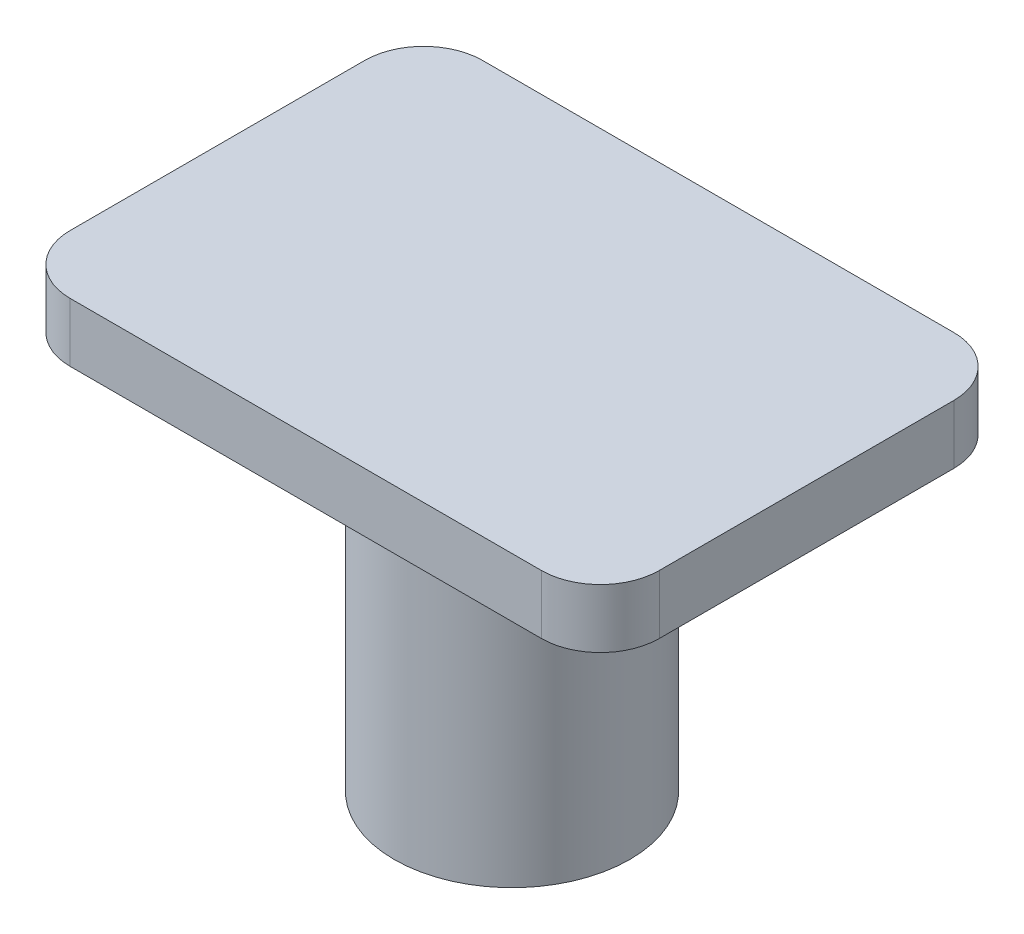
from build123d import *

# Parameters (mm, degrees)
SKETCH1_R           = 10
SKETCH1_R_2         = 8
EXTRUDE_THIN1_DEPTH = 30
SKETCH2_W           = 50
SKETCH2_H           = 35
EXTRUDE1_DEPTH      = 5
FILLET1_R           = 5


with BuildPart() as part:
    # Sketch1 → Extrude-Thin1 (new body)
    with BuildSketch(Plane(origin=(0, 0, 0), x_dir=(1, 0, 0), z_dir=(0, 1, 0))):
        Circle(SKETCH1_R)
        Circle(SKETCH1_R_2, mode=Mode.SUBTRACT)
    extrude(amount=EXTRUDE_THIN1_DEPTH)

    # Sketch2 → Extrude1 (add)
    with BuildSketch(Plane(origin=(0, 30, 0), x_dir=(-1, 0, 0), z_dir=(0, 1, 0))):
        Rectangle(SKETCH2_W, SKETCH2_H)
    extrude(amount=EXTRUDE1_DEPTH)

    # Fillet1
    fillet1_edges = [part.edges().sort_by_distance(p)[0] for p in [
        (-25, 32.5, 17.5),
        (25, 32.5, 17.5),
        (25, 32.5, -17.5),
        (-25, 32.5, -17.5),
    ]]
    fillet(fillet1_edges, radius=FILLET1_R)


solid = part.part
